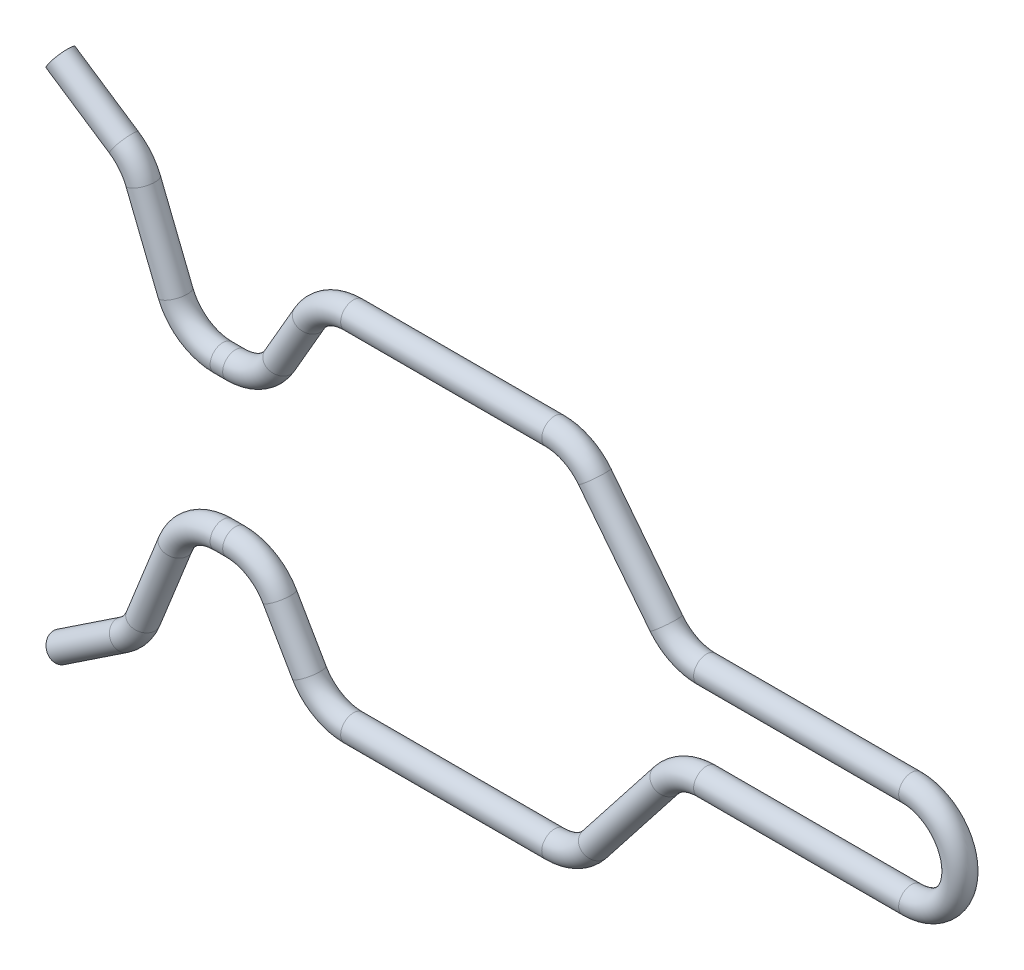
ISO-10303-21;
HEADER;
FILE_DESCRIPTION(('STEP AP214'),'2;1');
FILE_NAME('part.step','',(''),(''),'','','');
FILE_SCHEMA(('AUTOMOTIVE_DESIGN { 1 0 10303 214 1 1 1 1 }'));
ENDSEC;
DATA;
#1=APPLICATION_CONTEXT('core data for automotive mechanical design processes');
#2=APPLICATION_PROTOCOL_DEFINITION('international standard','automotive_design',2000,#1);
#3=PRODUCT_CONTEXT('',#1,'mechanical');
#4=PRODUCT('Part','Part','',(#3));
#5=PRODUCT_RELATED_PRODUCT_CATEGORY('part','',(#4));
#6=PRODUCT_DEFINITION_FORMATION('','',#4);
#7=PRODUCT_DEFINITION_CONTEXT('part definition',#1,'design');
#8=PRODUCT_DEFINITION('design','',#6,#7);
#9=PRODUCT_DEFINITION_SHAPE('','',#8);
#10=(LENGTH_UNIT() NAMED_UNIT(*) SI_UNIT(.MILLI.,.METRE.));
#11=(NAMED_UNIT(*) PLANE_ANGLE_UNIT() SI_UNIT($,.RADIAN.));
#12=(NAMED_UNIT(*) SI_UNIT($,.STERADIAN.) SOLID_ANGLE_UNIT());
#13=UNCERTAINTY_MEASURE_WITH_UNIT(LENGTH_MEASURE(1.E-05),#10,'distance_accuracy_value','');
#14=(GEOMETRIC_REPRESENTATION_CONTEXT(3) GLOBAL_UNCERTAINTY_ASSIGNED_CONTEXT((#13)) GLOBAL_UNIT_ASSIGNED_CONTEXT((#10,
#11,#12)) REPRESENTATION_CONTEXT('',''));
#15=CARTESIAN_POINT('',(0.,0.,0.));
#16=DIRECTION('',(0.,0.,1.));
#17=DIRECTION('',(1.,0.,0.));
#18=AXIS2_PLACEMENT_3D('',#15,#16,#17);
#19=CARTESIAN_POINT('',(-30.8262537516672,8.34456844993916,0.));
#20=DIRECTION('',(-0.832050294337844,0.554700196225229,0.));
#21=DIRECTION('',(-0.554700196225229,-0.832050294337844,0.));
#22=AXIS2_PLACEMENT_3D('',#19,#20,#21);
#23=CYLINDRICAL_SURFACE('',#22,0.5);
#24=CARTESIAN_POINT('',(-30.8262537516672,8.34456844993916,0.));
#25=DIRECTION('',(-0.832050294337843,0.55470019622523,0.));
#26=DIRECTION('',(0.,0.,1.));
#27=AXIS2_PLACEMENT_3D('',#24,#25,#26);
#28=CIRCLE('',#27,0.5);
#29=CARTESIAN_POINT('',(-30.5489036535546,8.76059359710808,0.));
#30=VERTEX_POINT('',#29);
#31=EDGE_CURVE('E35',#30,#30,#28,.T.);
#32=ORIENTED_EDGE('',*,*,#31,.T.);
#33=EDGE_LOOP('',(#32));
#34=FACE_BOUND('',#33,.T.);
#35=CARTESIAN_POINT('',(-33.3094010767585,10.,0.));
#36=DIRECTION('',(-0.832050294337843,0.55470019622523,0.));
#37=DIRECTION('',(0.,0.,1.));
#38=AXIS2_PLACEMENT_3D('',#35,#36,#37);
#39=CIRCLE('',#38,0.5);
#40=CARTESIAN_POINT('',(-33.3094010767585,10.,0.5));
#41=VERTEX_POINT('',#40);
#42=EDGE_CURVE('E10',#41,#41,#39,.T.);
#43=ORIENTED_EDGE('',*,*,#42,.F.);
#44=EDGE_LOOP('',(#43));
#45=FACE_BOUND('',#44,.T.);
#46=ADVANCED_FACE('F29',(#34,#45),#23,.T.);
#47=CARTESIAN_POINT('',(-31.9356541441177,6.68046786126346,0.));
#48=DIRECTION('',(0.,0.,1.));
#49=DIRECTION('',(1.,0.,0.));
#50=AXIS2_PLACEMENT_3D('',#47,#48,#49);
#51=TOROIDAL_SURFACE('',#50,2.,0.5);
#52=CARTESIAN_POINT('',(-30.0787007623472,7.42324921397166,0.));
#53=DIRECTION('',(-0.371390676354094,0.928476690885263,0.));
#54=DIRECTION('',(0.,0.,1.));
#55=AXIS2_PLACEMENT_3D('',#52,#53,#54);
#56=CIRCLE('',#55,0.5);
#57=CARTESIAN_POINT('',(-29.6144624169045,7.60894455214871,0.));
#58=VERTEX_POINT('',#57);
#59=EDGE_CURVE('E39',#58,#58,#56,.T.);
#60=CARTESIAN_POINT('',(-31.9356541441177,6.68046786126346,0.));
#61=DIRECTION('',(0.,0.,1.));
#62=DIRECTION('',(1.,0.,0.));
#63=AXIS2_PLACEMENT_3D('',#60,#61,#62);
#64=CIRCLE('',#63,2.5);
#65=EDGE_CURVE('',#58,#30,#64,.T.);
#66=ORIENTED_EDGE('',*,*,#59,.T.);
#67=ORIENTED_EDGE('',*,*,#31,.F.);
#68=ORIENTED_EDGE('',*,*,#65,.T.);
#69=ORIENTED_EDGE('',*,*,#65,.F.);
#70=EDGE_LOOP('',(#66,#68,#67,#69));
#71=FACE_BOUND('',#70,.T.);
#72=ADVANCED_FACE('F208',(#71),#51,.T.);
#73=CARTESIAN_POINT('',(-28.8122885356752,4.2572186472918,0.));
#74=DIRECTION('',(-0.371390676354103,0.92847669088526,0.));
#75=DIRECTION('',(-0.928476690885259,-0.371390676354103,0.));
#76=AXIS2_PLACEMENT_3D('',#73,#74,#75);
#77=CYLINDRICAL_SURFACE('',#76,0.5);
#78=CARTESIAN_POINT('',(-28.8122885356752,4.2572186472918,0.));
#79=DIRECTION('',(-0.371390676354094,0.928476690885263,0.));
#80=DIRECTION('',(0.,0.,1.));
#81=AXIS2_PLACEMENT_3D('',#78,#79,#80);
#82=CIRCLE('',#81,0.5);
#83=CARTESIAN_POINT('',(-29.2765268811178,4.07152330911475,0.));
#84=VERTEX_POINT('',#83);
#85=EDGE_CURVE('E43',#84,#84,#82,.T.);
#86=ORIENTED_EDGE('',*,*,#85,.T.);
#87=EDGE_LOOP('',(#86));
#88=FACE_BOUND('',#87,.T.);
#89=ORIENTED_EDGE('',*,*,#59,.F.);
#90=EDGE_LOOP('',(#89));
#91=FACE_BOUND('',#90,.T.);
#92=ADVANCED_FACE('F212',(#88,#91),#77,.T.);
#93=CARTESIAN_POINT('',(-26.9553351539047,5.,0.));
#94=DIRECTION('',(0.,0.,-1.));
#95=DIRECTION('',(-1.,0.,0.));
#96=AXIS2_PLACEMENT_3D('',#93,#94,#95);
#97=TOROIDAL_SURFACE('',#96,2.,0.5);
#98=CARTESIAN_POINT('',(-26.9553351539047,3.,0.));
#99=DIRECTION('',(-1.,0.,0.));
#100=DIRECTION('',(0.,0.,1.));
#101=AXIS2_PLACEMENT_3D('',#98,#99,#100);
#102=CIRCLE('',#101,0.5);
#103=CARTESIAN_POINT('',(-26.9553351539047,2.5,0.));
#104=VERTEX_POINT('',#103);
#105=EDGE_CURVE('E48',#104,#104,#102,.T.);
#106=CARTESIAN_POINT('',(-26.9553351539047,5.,0.));
#107=DIRECTION('',(0.,0.,-1.));
#108=DIRECTION('',(-1.,0.,0.));
#109=AXIS2_PLACEMENT_3D('',#106,#107,#108);
#110=CIRCLE('',#109,2.5);
#111=EDGE_CURVE('',#104,#84,#110,.T.);
#112=ORIENTED_EDGE('',*,*,#105,.T.);
#113=ORIENTED_EDGE('',*,*,#85,.F.);
#114=ORIENTED_EDGE('',*,*,#111,.T.);
#115=ORIENTED_EDGE('',*,*,#111,.F.);
#116=EDGE_LOOP('',(#112,#114,#113,#115));
#117=FACE_BOUND('',#116,.T.);
#118=ADVANCED_FACE('F218',(#117),#97,.T.);
#119=CARTESIAN_POINT('',(-26.4641016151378,3.,0.));
#120=DIRECTION('',(-1.,0.,0.));
#121=DIRECTION('',(0.,0.,1.));
#122=AXIS2_PLACEMENT_3D('',#119,#120,#121);
#123=CYLINDRICAL_SURFACE('',#122,0.5);
#124=CARTESIAN_POINT('',(-26.4641016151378,3.,0.));
#125=DIRECTION('',(-1.,0.,0.));
#126=DIRECTION('',(0.,0.,1.));
#127=AXIS2_PLACEMENT_3D('',#124,#125,#126);
#128=CIRCLE('',#127,0.5);
#129=CARTESIAN_POINT('',(-26.4641016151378,2.5,0.));
#130=VERTEX_POINT('',#129);
#131=EDGE_CURVE('E51',#130,#130,#128,.T.);
#132=ORIENTED_EDGE('',*,*,#131,.T.);
#133=EDGE_LOOP('',(#132));
#134=FACE_BOUND('',#133,.T.);
#135=ORIENTED_EDGE('',*,*,#105,.F.);
#136=EDGE_LOOP('',(#135));
#137=FACE_BOUND('',#136,.T.);
#138=ADVANCED_FACE('F225',(#134,#137),#123,.T.);
#139=CARTESIAN_POINT('',(-26.4641016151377,5.,0.));
#140=DIRECTION('',(0.,0.,-1.));
#141=DIRECTION('',(-1.,0.,0.));
#142=AXIS2_PLACEMENT_3D('',#139,#140,#141);
#143=TOROIDAL_SURFACE('',#142,2.,0.5);
#144=CARTESIAN_POINT('',(-24.7320508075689,4.,0.));
#145=DIRECTION('',(-0.49999999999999,-0.866025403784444,0.));
#146=DIRECTION('',(0.,0.,1.));
#147=AXIS2_PLACEMENT_3D('',#144,#145,#146);
#148=CIRCLE('',#147,0.5);
#149=CARTESIAN_POINT('',(-24.2990381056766,3.75,0.));
#150=VERTEX_POINT('',#149);
#151=EDGE_CURVE('E54',#150,#150,#148,.T.);
#152=CARTESIAN_POINT('',(-26.4641016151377,5.,0.));
#153=DIRECTION('',(0.,0.,-1.));
#154=DIRECTION('',(-1.,0.,0.));
#155=AXIS2_PLACEMENT_3D('',#152,#153,#154);
#156=CIRCLE('',#155,2.5);
#157=EDGE_CURVE('',#150,#130,#156,.T.);
#158=ORIENTED_EDGE('',*,*,#151,.T.);
#159=ORIENTED_EDGE('',*,*,#131,.F.);
#160=ORIENTED_EDGE('',*,*,#157,.T.);
#161=ORIENTED_EDGE('',*,*,#157,.F.);
#162=EDGE_LOOP('',(#158,#160,#159,#161));
#163=FACE_BOUND('',#162,.T.);
#164=ADVANCED_FACE('F229',(#163),#143,.T.);
#165=CARTESIAN_POINT('',(-23.5773502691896,5.99999999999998,0.));
#166=DIRECTION('',(-0.499999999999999,-0.866025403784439,0.));
#167=DIRECTION('',(0.866025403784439,-0.499999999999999,0.));
#168=AXIS2_PLACEMENT_3D('',#165,#166,#167);
#169=CYLINDRICAL_SURFACE('',#168,0.5);
#170=CARTESIAN_POINT('',(-23.5773502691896,5.99999999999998,0.));
#171=DIRECTION('',(-0.49999999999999,-0.866025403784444,0.));
#172=DIRECTION('',(0.,0.,1.));
#173=AXIS2_PLACEMENT_3D('',#170,#171,#172);
#174=CIRCLE('',#173,0.5);
#175=CARTESIAN_POINT('',(-24.0103629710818,6.24999999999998,0.));
#176=VERTEX_POINT('',#175);
#177=EDGE_CURVE('E57',#176,#176,#174,.T.);
#178=ORIENTED_EDGE('',*,*,#177,.T.);
#179=EDGE_LOOP('',(#178));
#180=FACE_BOUND('',#179,.T.);
#181=ORIENTED_EDGE('',*,*,#151,.F.);
#182=EDGE_LOOP('',(#181));
#183=FACE_BOUND('',#182,.T.);
#184=ADVANCED_FACE('F233',(#180,#183),#169,.T.);
#185=CARTESIAN_POINT('',(-21.8452994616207,5.,0.));
#186=DIRECTION('',(0.,0.,1.));
#187=DIRECTION('',(1.,0.,0.));
#188=AXIS2_PLACEMENT_3D('',#185,#186,#187);
#189=TOROIDAL_SURFACE('',#188,2.,0.5);
#190=CARTESIAN_POINT('',(-21.8452994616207,7.,0.));
#191=DIRECTION('',(-1.,0.,0.));
#192=DIRECTION('',(0.,0.,1.));
#193=AXIS2_PLACEMENT_3D('',#190,#191,#192);
#194=CIRCLE('',#193,0.5);
#195=CARTESIAN_POINT('',(-21.8452994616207,7.5,0.));
#196=VERTEX_POINT('',#195);
#197=EDGE_CURVE('E60',#196,#196,#194,.T.);
#198=CARTESIAN_POINT('',(-21.8452994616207,5.,0.));
#199=DIRECTION('',(0.,0.,1.));
#200=DIRECTION('',(1.,0.,0.));
#201=AXIS2_PLACEMENT_3D('',#198,#199,#200);
#202=CIRCLE('',#201,2.5);
#203=EDGE_CURVE('',#196,#176,#202,.T.);
#204=ORIENTED_EDGE('',*,*,#197,.T.);
#205=ORIENTED_EDGE('',*,*,#177,.F.);
#206=ORIENTED_EDGE('',*,*,#203,.T.);
#207=ORIENTED_EDGE('',*,*,#203,.F.);
#208=EDGE_LOOP('',(#204,#206,#205,#207));
#209=FACE_BOUND('',#208,.T.);
#210=ADVANCED_FACE('F237',(#209),#189,.T.);
#211=CARTESIAN_POINT('',(-13.9731420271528,7.,0.));
#212=DIRECTION('',(-1.,0.,0.));
#213=DIRECTION('',(0.,-1.,0.));
#214=AXIS2_PLACEMENT_3D('',#211,#212,#213);
#215=CYLINDRICAL_SURFACE('',#214,0.5);
#216=CARTESIAN_POINT('',(-13.9731420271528,7.,0.));
#217=DIRECTION('',(-1.,0.,0.));
#218=DIRECTION('',(0.,0.,1.));
#219=AXIS2_PLACEMENT_3D('',#216,#217,#218);
#220=CIRCLE('',#219,0.5);
#221=CARTESIAN_POINT('',(-13.9731420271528,7.5,0.));
#222=VERTEX_POINT('',#221);
#223=EDGE_CURVE('E63',#222,#222,#220,.T.);
#224=ORIENTED_EDGE('',*,*,#223,.T.);
#225=EDGE_LOOP('',(#224));
#226=FACE_BOUND('',#225,.T.);
#227=ORIENTED_EDGE('',*,*,#197,.F.);
#228=EDGE_LOOP('',(#227));
#229=FACE_BOUND('',#228,.T.);
#230=ADVANCED_FACE('F241',(#226,#229),#215,.T.);
#231=CARTESIAN_POINT('',(-13.9731420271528,5.,0.));
#232=DIRECTION('',(0.,0.,1.));
#233=DIRECTION('',(1.,0.,0.));
#234=AXIS2_PLACEMENT_3D('',#231,#232,#233);
#235=TOROIDAL_SURFACE('',#234,2.,0.5);
#236=CARTESIAN_POINT('',(-12.3994351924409,6.2342798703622,0.));
#237=DIRECTION('',(-0.617139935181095,0.78685341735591,0.));
#238=DIRECTION('',(0.,0.,1.));
#239=AXIS2_PLACEMENT_3D('',#236,#237,#238);
#240=CIRCLE('',#239,0.5);
#241=CARTESIAN_POINT('',(-12.006008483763,6.54284983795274,0.));
#242=VERTEX_POINT('',#241);
#243=EDGE_CURVE('E66',#242,#242,#240,.T.);
#244=CARTESIAN_POINT('',(-13.9731420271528,5.,0.));
#245=DIRECTION('',(0.,0.,1.));
#246=DIRECTION('',(1.,0.,0.));
#247=AXIS2_PLACEMENT_3D('',#244,#245,#246);
#248=CIRCLE('',#247,2.5);
#249=EDGE_CURVE('',#242,#222,#248,.T.);
#250=ORIENTED_EDGE('',*,*,#243,.T.);
#251=ORIENTED_EDGE('',*,*,#223,.F.);
#252=ORIENTED_EDGE('',*,*,#249,.T.);
#253=ORIENTED_EDGE('',*,*,#249,.F.);
#254=EDGE_LOOP('',(#250,#252,#251,#253));
#255=FACE_BOUND('',#254,.T.);
#256=ADVANCED_FACE('F245',(#255),#235,.T.);
#257=CARTESIAN_POINT('',(-9.60056480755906,2.6657201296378,0.));
#258=DIRECTION('',(-0.617139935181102,0.786853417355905,0.));
#259=DIRECTION('',(-0.786853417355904,-0.617139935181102,0.));
#260=AXIS2_PLACEMENT_3D('',#257,#258,#259);
#261=CYLINDRICAL_SURFACE('',#260,0.5);
#262=CARTESIAN_POINT('',(-9.60056480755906,2.6657201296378,0.));
#263=DIRECTION('',(-0.617139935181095,0.78685341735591,0.));
#264=DIRECTION('',(0.,0.,1.));
#265=AXIS2_PLACEMENT_3D('',#262,#263,#264);
#266=CIRCLE('',#265,0.5);
#267=CARTESIAN_POINT('',(-9.99399151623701,2.35715016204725,0.));
#268=VERTEX_POINT('',#267);
#269=EDGE_CURVE('E69',#268,#268,#266,.T.);
#270=ORIENTED_EDGE('',*,*,#269,.T.);
#271=EDGE_LOOP('',(#270));
#272=FACE_BOUND('',#271,.T.);
#273=ORIENTED_EDGE('',*,*,#243,.F.);
#274=EDGE_LOOP('',(#273));
#275=FACE_BOUND('',#274,.T.);
#276=ADVANCED_FACE('F249',(#272,#275),#261,.T.);
#277=CARTESIAN_POINT('',(-8.02685797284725,3.9,0.));
#278=DIRECTION('',(0.,0.,-1.));
#279=DIRECTION('',(-1.,0.,0.));
#280=AXIS2_PLACEMENT_3D('',#277,#278,#279);
#281=TOROIDAL_SURFACE('',#280,2.,0.5);
#282=CARTESIAN_POINT('',(-8.02685797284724,1.9,0.));
#283=DIRECTION('',(-1.,0.,0.));
#284=DIRECTION('',(0.,0.,1.));
#285=AXIS2_PLACEMENT_3D('',#282,#283,#284);
#286=CIRCLE('',#285,0.5);
#287=CARTESIAN_POINT('',(-8.02685797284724,1.4,0.));
#288=VERTEX_POINT('',#287);
#289=EDGE_CURVE('E72',#288,#288,#286,.T.);
#290=CARTESIAN_POINT('',(-8.02685797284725,3.9,0.));
#291=DIRECTION('',(0.,0.,-1.));
#292=DIRECTION('',(-1.,0.,0.));
#293=AXIS2_PLACEMENT_3D('',#290,#291,#292);
#294=CIRCLE('',#293,2.5);
#295=EDGE_CURVE('',#288,#268,#294,.T.);
#296=ORIENTED_EDGE('',*,*,#289,.T.);
#297=ORIENTED_EDGE('',*,*,#269,.F.);
#298=ORIENTED_EDGE('',*,*,#295,.T.);
#299=ORIENTED_EDGE('',*,*,#295,.F.);
#300=EDGE_LOOP('',(#296,#298,#297,#299));
#301=FACE_BOUND('',#300,.T.);
#302=ADVANCED_FACE('F253',(#301),#281,.T.);
#303=CARTESIAN_POINT('',(0.,1.9,0.));
#304=DIRECTION('',(-1.,0.,0.));
#305=DIRECTION('',(0.,0.,1.));
#306=AXIS2_PLACEMENT_3D('',#303,#304,#305);
#307=CYLINDRICAL_SURFACE('',#306,0.5);
#308=CARTESIAN_POINT('',(0.,1.9,0.));
#309=DIRECTION('',(-1.,0.,0.));
#310=DIRECTION('',(0.,0.,1.));
#311=AXIS2_PLACEMENT_3D('',#308,#309,#310);
#312=CIRCLE('',#311,0.5);
#313=CARTESIAN_POINT('',(0.,2.4,0.));
#314=VERTEX_POINT('',#313);
#315=EDGE_CURVE('E75',#314,#314,#312,.T.);
#316=ORIENTED_EDGE('',*,*,#315,.T.);
#317=EDGE_LOOP('',(#316));
#318=FACE_BOUND('',#317,.T.);
#319=ORIENTED_EDGE('',*,*,#289,.F.);
#320=EDGE_LOOP('',(#319));
#321=FACE_BOUND('',#320,.T.);
#322=ADVANCED_FACE('F257',(#318,#321),#307,.T.);
#323=CARTESIAN_POINT('',(0.,0.,0.));
#324=DIRECTION('',(0.,0.,-1.));
#325=DIRECTION('',(-1.,0.,0.));
#326=AXIS2_PLACEMENT_3D('',#323,#324,#325);
#327=TOROIDAL_SURFACE('',#326,1.9,0.5);
#328=CARTESIAN_POINT('',(0.,-1.9,0.));
#329=DIRECTION('',(1.,0.,0.));
#330=DIRECTION('',(0.,0.,1.));
#331=AXIS2_PLACEMENT_3D('',#328,#329,#330);
#332=CIRCLE('',#331,0.5);
#333=CARTESIAN_POINT('',(0.,-2.4,0.));
#334=VERTEX_POINT('',#333);
#335=EDGE_CURVE('E117',#334,#334,#332,.T.);
#336=CARTESIAN_POINT('',(0.,0.,0.));
#337=DIRECTION('',(0.,0.,-1.));
#338=DIRECTION('',(-1.,0.,0.));
#339=AXIS2_PLACEMENT_3D('',#336,#337,#338);
#340=CIRCLE('',#339,2.4);
#341=EDGE_CURVE('',#314,#334,#340,.T.);
#342=ORIENTED_EDGE('',*,*,#315,.F.);
#343=ORIENTED_EDGE('',*,*,#335,.T.);
#344=ORIENTED_EDGE('',*,*,#341,.T.);
#345=ORIENTED_EDGE('',*,*,#341,.F.);
#346=EDGE_LOOP('',(#342,#344,#343,#345));
#347=FACE_BOUND('',#346,.T.);
#348=ADVANCED_FACE('F121',(#347),#327,.T.);
#349=CARTESIAN_POINT('',(-33.3094010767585,10.,0.));
#350=DIRECTION('',(-0.832050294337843,0.55470019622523,0.));
#351=DIRECTION('',(0.,0.,1.));
#352=AXIS2_PLACEMENT_3D('',#349,#350,#351);
#353=PLANE('',#352);
#354=ORIENTED_EDGE('',*,*,#42,.T.);
#355=EDGE_LOOP('',(#354));
#356=FACE_BOUND('',#355,.T.);
#357=ADVANCED_FACE('F199',(#356),#353,.T.);
#358=CARTESIAN_POINT('',(-30.8262537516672,-8.34456844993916,0.));
#359=DIRECTION('',(-0.832050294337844,-0.554700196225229,0.));
#360=DIRECTION('',(0.554700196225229,-0.832050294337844,0.));
#361=AXIS2_PLACEMENT_3D('',#358,#359,#360);
#362=CYLINDRICAL_SURFACE('',#361,0.5);
#363=CARTESIAN_POINT('',(-30.8262537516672,-8.34456844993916,0.));
#364=DIRECTION('',(0.832050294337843,0.55470019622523,0.));
#365=DIRECTION('',(0.,0.,1.));
#366=AXIS2_PLACEMENT_3D('',#363,#364,#365);
#367=CIRCLE('',#366,0.5);
#368=CARTESIAN_POINT('',(-30.5489036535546,-8.76059359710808,0.));
#369=VERTEX_POINT('',#368);
#370=EDGE_CURVE('E81',#369,#369,#367,.T.);
#371=ORIENTED_EDGE('',*,*,#370,.F.);
#372=EDGE_LOOP('',(#371));
#373=FACE_BOUND('',#372,.T.);
#374=CARTESIAN_POINT('',(-33.3094010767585,-10.,0.));
#375=DIRECTION('',(0.832050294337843,0.55470019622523,0.));
#376=DIRECTION('',(0.,0.,1.));
#377=AXIS2_PLACEMENT_3D('',#374,#375,#376);
#378=CIRCLE('',#377,0.5);
#379=CARTESIAN_POINT('',(-33.3094010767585,-10.,0.5));
#380=VERTEX_POINT('',#379);
#381=EDGE_CURVE('E78',#380,#380,#378,.T.);
#382=ORIENTED_EDGE('',*,*,#381,.T.);
#383=EDGE_LOOP('',(#382));
#384=FACE_BOUND('',#383,.T.);
#385=ADVANCED_FACE('F193',(#373,#384),#362,.T.);
#386=CARTESIAN_POINT('',(-31.9356541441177,-6.68046786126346,0.));
#387=DIRECTION('',(0.,0.,-1.));
#388=DIRECTION('',(-1.,0.,0.));
#389=AXIS2_PLACEMENT_3D('',#386,#387,#388);
#390=TOROIDAL_SURFACE('',#389,2.,0.5);
#391=CARTESIAN_POINT('',(-30.0787007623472,-7.42324921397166,0.));
#392=DIRECTION('',(0.371390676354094,0.928476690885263,0.));
#393=DIRECTION('',(0.,0.,1.));
#394=AXIS2_PLACEMENT_3D('',#391,#392,#393);
#395=CIRCLE('',#394,0.5);
#396=CARTESIAN_POINT('',(-29.6144624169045,-7.60894455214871,0.));
#397=VERTEX_POINT('',#396);
#398=EDGE_CURVE('E84',#397,#397,#395,.T.);
#399=CARTESIAN_POINT('',(-31.9356541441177,-6.68046786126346,0.));
#400=DIRECTION('',(0.,0.,-1.));
#401=DIRECTION('',(-1.,0.,0.));
#402=AXIS2_PLACEMENT_3D('',#399,#400,#401);
#403=CIRCLE('',#402,2.5);
#404=EDGE_CURVE('',#397,#369,#403,.T.);
#405=ORIENTED_EDGE('',*,*,#398,.F.);
#406=ORIENTED_EDGE('',*,*,#370,.T.);
#407=ORIENTED_EDGE('',*,*,#404,.T.);
#408=ORIENTED_EDGE('',*,*,#404,.F.);
#409=EDGE_LOOP('',(#405,#407,#406,#408));
#410=FACE_BOUND('',#409,.T.);
#411=ADVANCED_FACE('F187',(#410),#390,.T.);
#412=CARTESIAN_POINT('',(-28.8122885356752,-4.2572186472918,0.));
#413=DIRECTION('',(-0.371390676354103,-0.92847669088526,0.));
#414=DIRECTION('',(0.928476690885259,-0.371390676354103,0.));
#415=AXIS2_PLACEMENT_3D('',#412,#413,#414);
#416=CYLINDRICAL_SURFACE('',#415,0.5);
#417=CARTESIAN_POINT('',(-28.8122885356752,-4.2572186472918,0.));
#418=DIRECTION('',(0.371390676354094,0.928476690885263,0.));
#419=DIRECTION('',(0.,0.,1.));
#420=AXIS2_PLACEMENT_3D('',#417,#418,#419);
#421=CIRCLE('',#420,0.5);
#422=CARTESIAN_POINT('',(-29.2765268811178,-4.07152330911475,0.));
#423=VERTEX_POINT('',#422);
#424=EDGE_CURVE('E87',#423,#423,#421,.T.);
#425=ORIENTED_EDGE('',*,*,#424,.F.);
#426=EDGE_LOOP('',(#425));
#427=FACE_BOUND('',#426,.T.);
#428=ORIENTED_EDGE('',*,*,#398,.T.);
#429=EDGE_LOOP('',(#428));
#430=FACE_BOUND('',#429,.T.);
#431=ADVANCED_FACE('F181',(#427,#430),#416,.T.);
#432=CARTESIAN_POINT('',(-26.9553351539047,-5.,0.));
#433=DIRECTION('',(0.,0.,1.));
#434=DIRECTION('',(1.,0.,0.));
#435=AXIS2_PLACEMENT_3D('',#432,#433,#434);
#436=TOROIDAL_SURFACE('',#435,2.,0.5);
#437=CARTESIAN_POINT('',(-26.9553351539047,-3.,0.));
#438=DIRECTION('',(1.,0.,0.));
#439=DIRECTION('',(0.,0.,1.));
#440=AXIS2_PLACEMENT_3D('',#437,#438,#439);
#441=CIRCLE('',#440,0.5);
#442=CARTESIAN_POINT('',(-26.9553351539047,-2.5,0.));
#443=VERTEX_POINT('',#442);
#444=EDGE_CURVE('E90',#443,#443,#441,.T.);
#445=CARTESIAN_POINT('',(-26.9553351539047,-5.,0.));
#446=DIRECTION('',(0.,0.,1.));
#447=DIRECTION('',(1.,0.,0.));
#448=AXIS2_PLACEMENT_3D('',#445,#446,#447);
#449=CIRCLE('',#448,2.5);
#450=EDGE_CURVE('',#443,#423,#449,.T.);
#451=ORIENTED_EDGE('',*,*,#444,.F.);
#452=ORIENTED_EDGE('',*,*,#424,.T.);
#453=ORIENTED_EDGE('',*,*,#450,.T.);
#454=ORIENTED_EDGE('',*,*,#450,.F.);
#455=EDGE_LOOP('',(#451,#453,#452,#454));
#456=FACE_BOUND('',#455,.T.);
#457=ADVANCED_FACE('F175',(#456),#436,.T.);
#458=CARTESIAN_POINT('',(-26.4641016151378,-3.,0.));
#459=DIRECTION('',(-1.,0.,0.));
#460=DIRECTION('',(0.,0.,1.));
#461=AXIS2_PLACEMENT_3D('',#458,#459,#460);
#462=CYLINDRICAL_SURFACE('',#461,0.5);
#463=CARTESIAN_POINT('',(-26.4641016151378,-3.,0.));
#464=DIRECTION('',(1.,0.,0.));
#465=DIRECTION('',(0.,0.,1.));
#466=AXIS2_PLACEMENT_3D('',#463,#464,#465);
#467=CIRCLE('',#466,0.5);
#468=CARTESIAN_POINT('',(-26.4641016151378,-2.5,0.));
#469=VERTEX_POINT('',#468);
#470=EDGE_CURVE('E93',#469,#469,#467,.T.);
#471=ORIENTED_EDGE('',*,*,#470,.F.);
#472=EDGE_LOOP('',(#471));
#473=FACE_BOUND('',#472,.T.);
#474=ORIENTED_EDGE('',*,*,#444,.T.);
#475=EDGE_LOOP('',(#474));
#476=FACE_BOUND('',#475,.T.);
#477=ADVANCED_FACE('F169',(#473,#476),#462,.T.);
#478=CARTESIAN_POINT('',(-26.4641016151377,-5.,0.));
#479=DIRECTION('',(0.,0.,1.));
#480=DIRECTION('',(1.,0.,0.));
#481=AXIS2_PLACEMENT_3D('',#478,#479,#480);
#482=TOROIDAL_SURFACE('',#481,2.,0.5);
#483=CARTESIAN_POINT('',(-24.7320508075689,-4.,0.));
#484=DIRECTION('',(0.49999999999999,-0.866025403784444,0.));
#485=DIRECTION('',(0.,0.,1.));
#486=AXIS2_PLACEMENT_3D('',#483,#484,#485);
#487=CIRCLE('',#486,0.5);
#488=CARTESIAN_POINT('',(-24.2990381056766,-3.75,0.));
#489=VERTEX_POINT('',#488);
#490=EDGE_CURVE('E96',#489,#489,#487,.T.);
#491=CARTESIAN_POINT('',(-26.4641016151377,-5.,0.));
#492=DIRECTION('',(0.,0.,1.));
#493=DIRECTION('',(1.,0.,0.));
#494=AXIS2_PLACEMENT_3D('',#491,#492,#493);
#495=CIRCLE('',#494,2.5);
#496=EDGE_CURVE('',#489,#469,#495,.T.);
#497=ORIENTED_EDGE('',*,*,#490,.F.);
#498=ORIENTED_EDGE('',*,*,#470,.T.);
#499=ORIENTED_EDGE('',*,*,#496,.T.);
#500=ORIENTED_EDGE('',*,*,#496,.F.);
#501=EDGE_LOOP('',(#497,#499,#498,#500));
#502=FACE_BOUND('',#501,.T.);
#503=ADVANCED_FACE('F163',(#502),#482,.T.);
#504=CARTESIAN_POINT('',(-23.5773502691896,-5.99999999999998,0.));
#505=DIRECTION('',(-0.499999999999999,0.866025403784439,0.));
#506=DIRECTION('',(-0.866025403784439,-0.499999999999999,0.));
#507=AXIS2_PLACEMENT_3D('',#504,#505,#506);
#508=CYLINDRICAL_SURFACE('',#507,0.5);
#509=CARTESIAN_POINT('',(-23.5773502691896,-5.99999999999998,0.));
#510=DIRECTION('',(0.49999999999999,-0.866025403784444,0.));
#511=DIRECTION('',(0.,0.,1.));
#512=AXIS2_PLACEMENT_3D('',#509,#510,#511);
#513=CIRCLE('',#512,0.5);
#514=CARTESIAN_POINT('',(-24.0103629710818,-6.24999999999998,0.));
#515=VERTEX_POINT('',#514);
#516=EDGE_CURVE('E99',#515,#515,#513,.T.);
#517=ORIENTED_EDGE('',*,*,#516,.F.);
#518=EDGE_LOOP('',(#517));
#519=FACE_BOUND('',#518,.T.);
#520=ORIENTED_EDGE('',*,*,#490,.T.);
#521=EDGE_LOOP('',(#520));
#522=FACE_BOUND('',#521,.T.);
#523=ADVANCED_FACE('F157',(#519,#522),#508,.T.);
#524=CARTESIAN_POINT('',(-21.8452994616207,-5.,0.));
#525=DIRECTION('',(0.,0.,-1.));
#526=DIRECTION('',(-1.,0.,0.));
#527=AXIS2_PLACEMENT_3D('',#524,#525,#526);
#528=TOROIDAL_SURFACE('',#527,2.,0.5);
#529=CARTESIAN_POINT('',(-21.8452994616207,-7.,0.));
#530=DIRECTION('',(1.,0.,0.));
#531=DIRECTION('',(0.,0.,1.));
#532=AXIS2_PLACEMENT_3D('',#529,#530,#531);
#533=CIRCLE('',#532,0.5);
#534=CARTESIAN_POINT('',(-21.8452994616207,-7.5,0.));
#535=VERTEX_POINT('',#534);
#536=EDGE_CURVE('E102',#535,#535,#533,.T.);
#537=CARTESIAN_POINT('',(-21.8452994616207,-5.,0.));
#538=DIRECTION('',(0.,0.,-1.));
#539=DIRECTION('',(-1.,0.,0.));
#540=AXIS2_PLACEMENT_3D('',#537,#538,#539);
#541=CIRCLE('',#540,2.5);
#542=EDGE_CURVE('',#535,#515,#541,.T.);
#543=ORIENTED_EDGE('',*,*,#536,.F.);
#544=ORIENTED_EDGE('',*,*,#516,.T.);
#545=ORIENTED_EDGE('',*,*,#542,.T.);
#546=ORIENTED_EDGE('',*,*,#542,.F.);
#547=EDGE_LOOP('',(#543,#545,#544,#546));
#548=FACE_BOUND('',#547,.T.);
#549=ADVANCED_FACE('F151',(#548),#528,.T.);
#550=CARTESIAN_POINT('',(-13.9731420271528,-7.,0.));
#551=DIRECTION('',(-1.,0.,0.));
#552=DIRECTION('',(0.,-1.,0.));
#553=AXIS2_PLACEMENT_3D('',#550,#551,#552);
#554=CYLINDRICAL_SURFACE('',#553,0.5);
#555=CARTESIAN_POINT('',(-13.9731420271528,-7.,0.));
#556=DIRECTION('',(1.,0.,0.));
#557=DIRECTION('',(0.,0.,1.));
#558=AXIS2_PLACEMENT_3D('',#555,#556,#557);
#559=CIRCLE('',#558,0.5);
#560=CARTESIAN_POINT('',(-13.9731420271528,-7.5,0.));
#561=VERTEX_POINT('',#560);
#562=EDGE_CURVE('E105',#561,#561,#559,.T.);
#563=ORIENTED_EDGE('',*,*,#562,.F.);
#564=EDGE_LOOP('',(#563));
#565=FACE_BOUND('',#564,.T.);
#566=ORIENTED_EDGE('',*,*,#536,.T.);
#567=EDGE_LOOP('',(#566));
#568=FACE_BOUND('',#567,.T.);
#569=ADVANCED_FACE('F145',(#565,#568),#554,.T.);
#570=CARTESIAN_POINT('',(-13.9731420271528,-5.,0.));
#571=DIRECTION('',(0.,0.,-1.));
#572=DIRECTION('',(-1.,0.,0.));
#573=AXIS2_PLACEMENT_3D('',#570,#571,#572);
#574=TOROIDAL_SURFACE('',#573,2.,0.5);
#575=CARTESIAN_POINT('',(-12.3994351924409,-6.2342798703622,0.));
#576=DIRECTION('',(0.617139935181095,0.78685341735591,0.));
#577=DIRECTION('',(0.,0.,1.));
#578=AXIS2_PLACEMENT_3D('',#575,#576,#577);
#579=CIRCLE('',#578,0.5);
#580=CARTESIAN_POINT('',(-12.006008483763,-6.54284983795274,0.));
#581=VERTEX_POINT('',#580);
#582=EDGE_CURVE('E108',#581,#581,#579,.T.);
#583=CARTESIAN_POINT('',(-13.9731420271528,-5.,0.));
#584=DIRECTION('',(0.,0.,-1.));
#585=DIRECTION('',(-1.,0.,0.));
#586=AXIS2_PLACEMENT_3D('',#583,#584,#585);
#587=CIRCLE('',#586,2.5);
#588=EDGE_CURVE('',#581,#561,#587,.T.);
#589=ORIENTED_EDGE('',*,*,#582,.F.);
#590=ORIENTED_EDGE('',*,*,#562,.T.);
#591=ORIENTED_EDGE('',*,*,#588,.T.);
#592=ORIENTED_EDGE('',*,*,#588,.F.);
#593=EDGE_LOOP('',(#589,#591,#590,#592));
#594=FACE_BOUND('',#593,.T.);
#595=ADVANCED_FACE('F139',(#594),#574,.T.);
#596=CARTESIAN_POINT('',(-9.60056480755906,-2.6657201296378,0.));
#597=DIRECTION('',(-0.617139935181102,-0.786853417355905,0.));
#598=DIRECTION('',(0.786853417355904,-0.617139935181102,0.));
#599=AXIS2_PLACEMENT_3D('',#596,#597,#598);
#600=CYLINDRICAL_SURFACE('',#599,0.5);
#601=CARTESIAN_POINT('',(-9.60056480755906,-2.6657201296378,0.));
#602=DIRECTION('',(0.617139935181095,0.78685341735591,0.));
#603=DIRECTION('',(0.,0.,1.));
#604=AXIS2_PLACEMENT_3D('',#601,#602,#603);
#605=CIRCLE('',#604,0.5);
#606=CARTESIAN_POINT('',(-9.99399151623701,-2.35715016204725,0.));
#607=VERTEX_POINT('',#606);
#608=EDGE_CURVE('E111',#607,#607,#605,.T.);
#609=ORIENTED_EDGE('',*,*,#608,.F.);
#610=EDGE_LOOP('',(#609));
#611=FACE_BOUND('',#610,.T.);
#612=ORIENTED_EDGE('',*,*,#582,.T.);
#613=EDGE_LOOP('',(#612));
#614=FACE_BOUND('',#613,.T.);
#615=ADVANCED_FACE('F133',(#611,#614),#600,.T.);
#616=CARTESIAN_POINT('',(-8.02685797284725,-3.9,0.));
#617=DIRECTION('',(0.,0.,1.));
#618=DIRECTION('',(1.,0.,0.));
#619=AXIS2_PLACEMENT_3D('',#616,#617,#618);
#620=TOROIDAL_SURFACE('',#619,2.,0.5);
#621=CARTESIAN_POINT('',(-8.02685797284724,-1.9,0.));
#622=DIRECTION('',(1.,0.,0.));
#623=DIRECTION('',(0.,0.,1.));
#624=AXIS2_PLACEMENT_3D('',#621,#622,#623);
#625=CIRCLE('',#624,0.5);
#626=CARTESIAN_POINT('',(-8.02685797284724,-1.4,0.));
#627=VERTEX_POINT('',#626);
#628=EDGE_CURVE('E114',#627,#627,#625,.T.);
#629=CARTESIAN_POINT('',(-8.02685797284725,-3.9,0.));
#630=DIRECTION('',(0.,0.,1.));
#631=DIRECTION('',(1.,0.,0.));
#632=AXIS2_PLACEMENT_3D('',#629,#630,#631);
#633=CIRCLE('',#632,2.5);
#634=EDGE_CURVE('',#627,#607,#633,.T.);
#635=ORIENTED_EDGE('',*,*,#628,.F.);
#636=ORIENTED_EDGE('',*,*,#608,.T.);
#637=ORIENTED_EDGE('',*,*,#634,.T.);
#638=ORIENTED_EDGE('',*,*,#634,.F.);
#639=EDGE_LOOP('',(#635,#637,#636,#638));
#640=FACE_BOUND('',#639,.T.);
#641=ADVANCED_FACE('F127',(#640),#620,.T.);
#642=CARTESIAN_POINT('',(0.,-1.9,0.));
#643=DIRECTION('',(-1.,0.,0.));
#644=DIRECTION('',(0.,0.,1.));
#645=AXIS2_PLACEMENT_3D('',#642,#643,#644);
#646=CYLINDRICAL_SURFACE('',#645,0.5);
#647=ORIENTED_EDGE('',*,*,#335,.F.);
#648=EDGE_LOOP('',(#647));
#649=FACE_BOUND('',#648,.T.);
#650=ORIENTED_EDGE('',*,*,#628,.T.);
#651=EDGE_LOOP('',(#650));
#652=FACE_BOUND('',#651,.T.);
#653=ADVANCED_FACE('F123',(#649,#652),#646,.T.);
#654=CARTESIAN_POINT('',(-33.3094010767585,-10.,0.));
#655=DIRECTION('',(-0.832050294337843,-0.55470019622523,0.));
#656=DIRECTION('',(0.,0.,1.));
#657=AXIS2_PLACEMENT_3D('',#654,#655,#656);
#658=PLANE('',#657);
#659=ORIENTED_EDGE('',*,*,#381,.F.);
#660=EDGE_LOOP('',(#659));
#661=FACE_BOUND('',#660,.T.);
#662=ADVANCED_FACE('F126',(#661),#658,.T.);
#663=CLOSED_SHELL('',(#46,#72,#92,#118,#138,#164,#184,#210,#230,#256,#276,#302,#322,#348,#357,
#385,#411,#431,#457,#477,#503,#523,#549,#569,#595,#615,#641,#653,#662));
#664=MANIFOLD_SOLID_BREP('B2',#663);
#665=ADVANCED_BREP_SHAPE_REPRESENTATION('',(#18,#664),#14);
#666=SHAPE_DEFINITION_REPRESENTATION(#9,#665);
ENDSEC;
END-ISO-10303-21;
